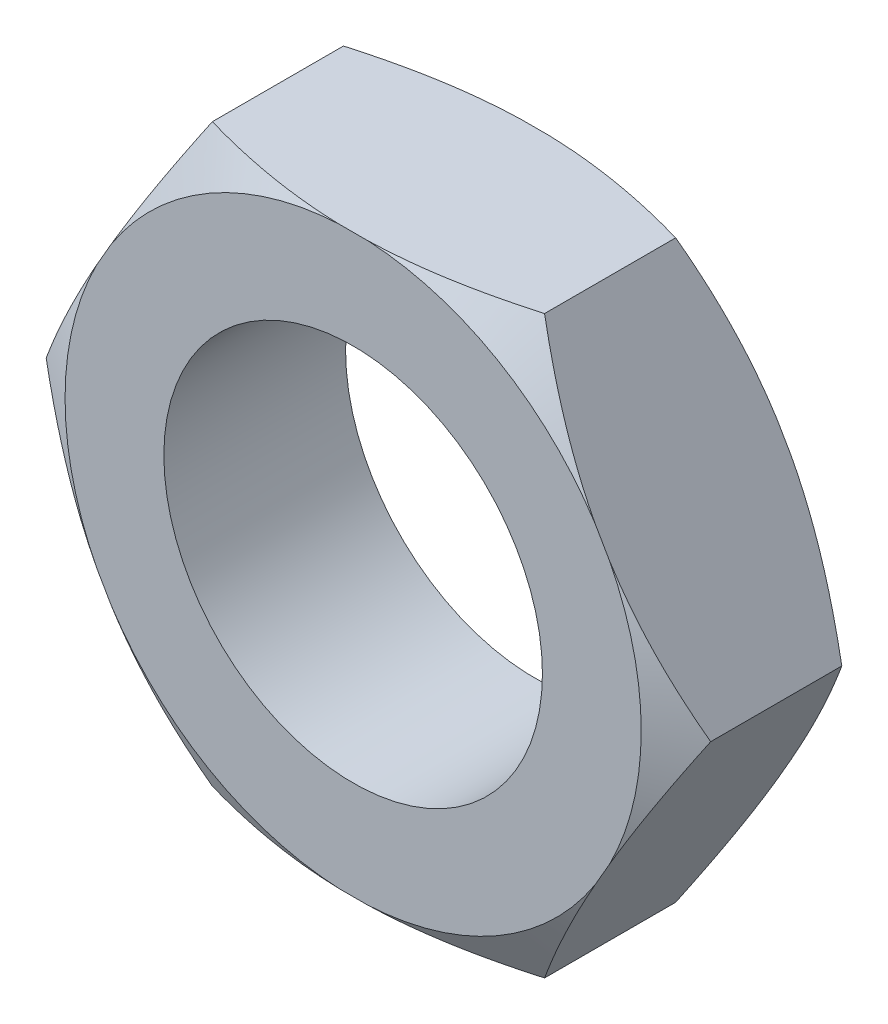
from build123d import *

# Parameters (mm, degrees)
SKETCH2_R          = 4.7625
BASE_EXTRUDE_DEPTH = 2.286


with BuildPart() as part:
    # Sketch2 → Base-Extrude (new, symmetric)
    with BuildSketch(Plane.XY):
        Polygon((4.179438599, -7.239), (8.358877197, 0), (4.179438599, 7.239), (-4.179438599, 7.239), (-8.358877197, 0), (-4.179438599, -7.239), align=None)
        Circle(SKETCH2_R, mode=Mode.SUBTRACT)
    extrude(amount=BASE_EXTRUDE_DEPTH, both=True)

    # Sketch4 → Cut-Revolve1 (revolve, cut)
    with BuildSketch(Plane(origin=(0, 0, 0), x_dir=(1, 0, 0), z_dir=(0, 1, 0))):
        Polygon((7.247897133, 2.286), (8.358877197, 1.64964364), (8.358877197, 2.286), align=None)
        Polygon((7.247897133, -2.286), (8.358877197, -1.64964364), (8.358877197, -2.286), align=None)
    revolve(axis=Axis((0, 0, -3.557999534), (0, 0, 1)), mode=Mode.SUBTRACT)


solid = part.part
